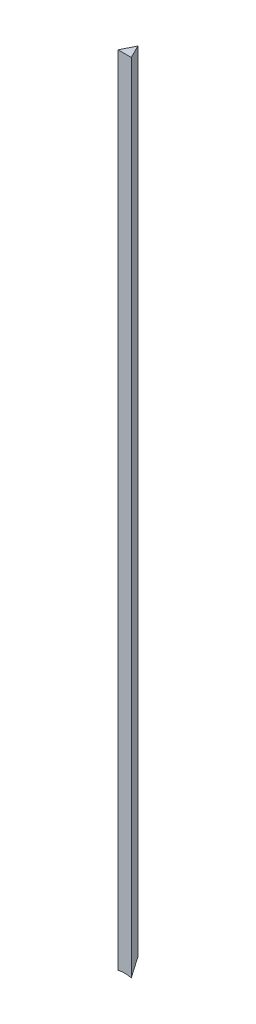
from build123d import *

# Parameters (mm, degrees)
AUFSATZ_LINEAR_AUSTRAGEN1_DEPTH = 838.1
SKIZZE2_R                       = 31.5
SCHNITT_LINEAR_AUSTRAGEN1_DEPTH = 1446.634577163


with BuildPart() as part:
    # Skizze1 → Aufsatz-Linear austragen1 (new body)
    with BuildSketch(Plane(origin=(0, 0, 0), x_dir=(1, 0, 0), z_dir=(0, 1, 0))):
        Polygon((0, 0), (-6.692967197, -13.424015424), (6.692967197, -13.424015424), align=None)
    extrude(amount=AUFSATZ_LINEAR_AUSTRAGEN1_DEPTH)

    # Skizze2 → Schnitt-Linear austragen1 (cut, through all)
    with BuildSketch(Plane(origin=(607.653249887, -269.212979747, -683.925266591), x_dir=(-0.6502676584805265, -0.6869893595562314, -0.32434178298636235), z_dir=(-0.0844558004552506, 0.48965522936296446, -0.8678162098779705))):
        with Locations((-11.634736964, 860.769841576)):
            Circle(SKIZZE2_R)
    extrude(amount=-SCHNITT_LINEAR_AUSTRAGEN1_DEPTH, mode=Mode.SUBTRACT)


solid = part.part
